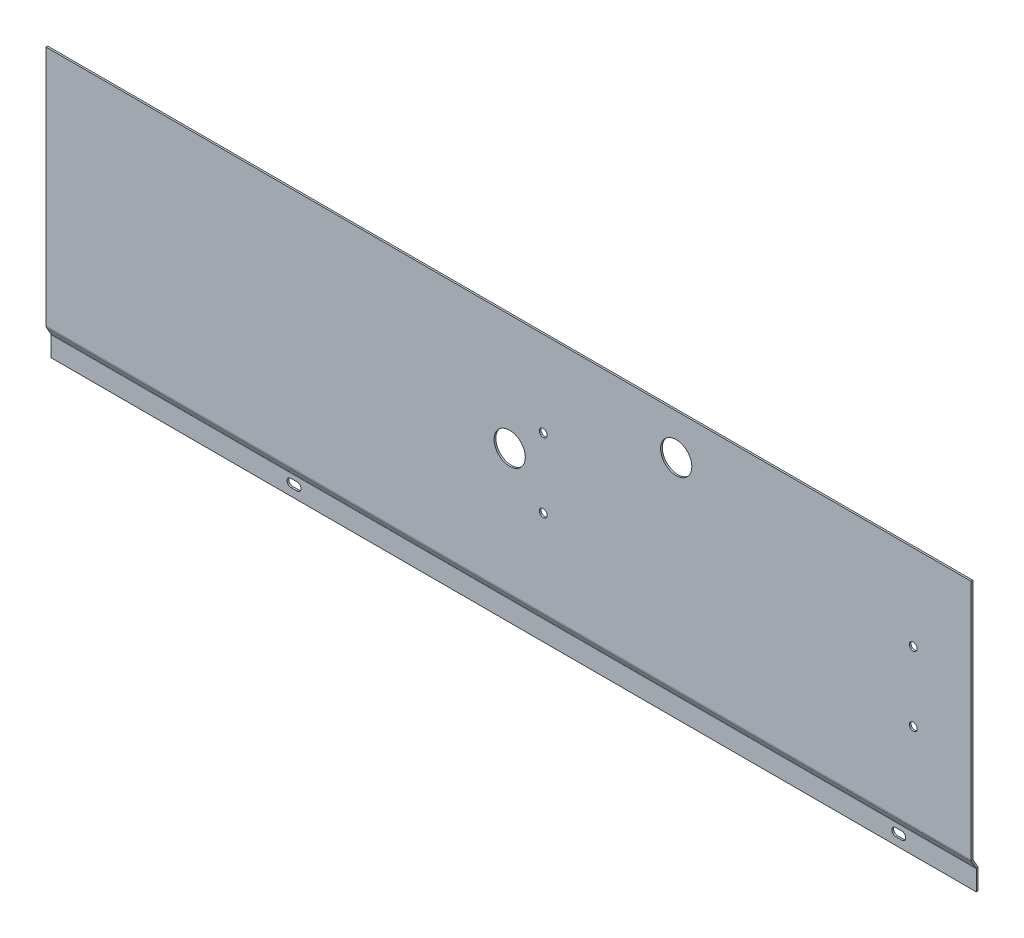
ISO-10303-21;
HEADER;
FILE_DESCRIPTION(('STEP AP214'),'2;1');
FILE_NAME('part.step','',(''),(''),'','','');
FILE_SCHEMA(('AUTOMOTIVE_DESIGN { 1 0 10303 214 1 1 1 1 }'));
ENDSEC;
DATA;
#1=APPLICATION_CONTEXT('core data for automotive mechanical design processes');
#2=APPLICATION_PROTOCOL_DEFINITION('international standard','automotive_design',2000,#1);
#3=PRODUCT_CONTEXT('',#1,'mechanical');
#4=PRODUCT('Part','Part','',(#3));
#5=PRODUCT_RELATED_PRODUCT_CATEGORY('part','',(#4));
#6=PRODUCT_DEFINITION_FORMATION('','',#4);
#7=PRODUCT_DEFINITION_CONTEXT('part definition',#1,'design');
#8=PRODUCT_DEFINITION('design','',#6,#7);
#9=PRODUCT_DEFINITION_SHAPE('','',#8);
#10=(LENGTH_UNIT() NAMED_UNIT(*) SI_UNIT(.MILLI.,.METRE.));
#11=(NAMED_UNIT(*) PLANE_ANGLE_UNIT() SI_UNIT($,.RADIAN.));
#12=(NAMED_UNIT(*) SI_UNIT($,.STERADIAN.) SOLID_ANGLE_UNIT());
#13=UNCERTAINTY_MEASURE_WITH_UNIT(LENGTH_MEASURE(1.E-05),#10,'distance_accuracy_value','');
#14=(GEOMETRIC_REPRESENTATION_CONTEXT(3) GLOBAL_UNCERTAINTY_ASSIGNED_CONTEXT((#13)) GLOBAL_UNIT_ASSIGNED_CONTEXT((#10,
#11,#12)) REPRESENTATION_CONTEXT('',''));
#15=CARTESIAN_POINT('',(0.,0.,0.));
#16=DIRECTION('',(0.,0.,1.));
#17=DIRECTION('',(1.,0.,0.));
#18=AXIS2_PLACEMENT_3D('',#15,#16,#17);
#19=CARTESIAN_POINT('',(800.,17.1961524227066,0.));
#20=DIRECTION('',(1.,0.,0.));
#21=DIRECTION('',(0.,0.,-1.));
#22=AXIS2_PLACEMENT_3D('',#19,#20,#21);
#23=PLANE('',#22);
#24=DIRECTION('',(0.,0.,1.));
#25=VECTOR('',#24,1.);
#26=CARTESIAN_POINT('',(800.,17.1961524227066,0.));
#27=LINE('',#26,#25);
#28=CARTESIAN_POINT('',(800.,17.1961524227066,0.));
#29=VERTEX_POINT('',#28);
#30=CARTESIAN_POINT('',(800.,17.1961524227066,1.5));
#31=VERTEX_POINT('',#30);
#32=EDGE_CURVE('E11',#29,#31,#27,.T.);
#33=ORIENTED_EDGE('',*,*,#32,.F.);
#34=CARTESIAN_POINT('',(800.,17.1961524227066,3.));
#35=DIRECTION('',(-1.,0.,0.));
#36=DIRECTION('',(0.,0.,1.));
#37=AXIS2_PLACEMENT_3D('',#34,#35,#36);
#38=CIRCLE('',#37,3.);
#39=CARTESIAN_POINT('',(800.,18.6961524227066,0.401923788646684));
#40=VERTEX_POINT('',#39);
#41=EDGE_CURVE('E350',#29,#40,#38,.F.);
#42=ORIENTED_EDGE('',*,*,#41,.T.);
#43=DIRECTION('',(0.,0.5,-0.866025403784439));
#44=VECTOR('',#43,1.);
#45=CARTESIAN_POINT('',(800.,17.9461524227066,1.70096189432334));
#46=LINE('',#45,#44);
#47=CARTESIAN_POINT('',(800.,17.9461524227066,1.70096189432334));
#48=VERTEX_POINT('',#47);
#49=EDGE_CURVE('E48',#48,#40,#46,.T.);
#50=ORIENTED_EDGE('',*,*,#49,.F.);
#51=CARTESIAN_POINT('',(800.,17.1961524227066,3.));
#52=DIRECTION('',(1.,0.,0.));
#53=DIRECTION('',(0.,0.,-1.));
#54=AXIS2_PLACEMENT_3D('',#51,#52,#53);
#55=CIRCLE('',#54,1.5);
#56=EDGE_CURVE('E334',#31,#48,#55,.T.);
#57=ORIENTED_EDGE('',*,*,#56,.F.);
#58=EDGE_LOOP('',(#33,#42,#50,#57));
#59=FACE_BOUND('',#58,.T.);
#60=ADVANCED_FACE('F40',(#59),#23,.T.);
#61=CARTESIAN_POINT('',(800.,17.9461524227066,1.70096189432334));
#62=DIRECTION('',(1.,0.,0.));
#63=DIRECTION('',(0.,0.,-1.));
#64=AXIS2_PLACEMENT_3D('',#61,#62,#63);
#65=PLANE('',#64);
#66=DIRECTION('',(0.,1.,0.));
#67=VECTOR('',#66,1.);
#68=CARTESIAN_POINT('',(800.,0.,0.));
#69=LINE('',#68,#67);
#70=CARTESIAN_POINT('',(800.,0.,0.));
#71=VERTEX_POINT('',#70);
#72=EDGE_CURVE('E346',#71,#29,#69,.T.);
#73=ORIENTED_EDGE('',*,*,#72,.T.);
#74=ORIENTED_EDGE('',*,*,#32,.T.);
#75=DIRECTION('',(0.,1.,0.));
#76=VECTOR('',#75,1.);
#77=CARTESIAN_POINT('',(800.,0.,1.5));
#78=LINE('',#77,#76);
#79=CARTESIAN_POINT('',(800.,0.,1.5));
#80=VERTEX_POINT('',#79);
#81=EDGE_CURVE('E338',#80,#31,#78,.T.);
#82=ORIENTED_EDGE('',*,*,#81,.F.);
#83=DIRECTION('',(0.,0.,1.));
#84=VECTOR('',#83,1.);
#85=CARTESIAN_POINT('',(800.,0.,0.));
#86=LINE('',#85,#84);
#87=EDGE_CURVE('E342',#71,#80,#86,.T.);
#88=ORIENTED_EDGE('',*,*,#87,.F.);
#89=EDGE_LOOP('',(#73,#74,#82,#88));
#90=FACE_BOUND('',#89,.T.);
#91=ADVANCED_FACE('F466',(#90),#65,.T.);
#92=CARTESIAN_POINT('',(0.,18.6961524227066,0.401923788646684));
#93=DIRECTION('',(-1.,0.,0.));
#94=DIRECTION('',(0.,0.,1.));
#95=AXIS2_PLACEMENT_3D('',#92,#93,#94);
#96=PLANE('',#95);
#97=DIRECTION('',(0.,-0.5,0.866025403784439));
#98=VECTOR('',#97,1.);
#99=CARTESIAN_POINT('',(0.,18.6961524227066,0.401923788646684));
#100=LINE('',#99,#98);
#101=CARTESIAN_POINT('',(0.,18.6961524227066,0.401923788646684));
#102=VERTEX_POINT('',#101);
#103=CARTESIAN_POINT('',(0.,17.9461524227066,1.70096189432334));
#104=VERTEX_POINT('',#103);
#105=EDGE_CURVE('E421',#102,#104,#100,.T.);
#106=ORIENTED_EDGE('',*,*,#105,.F.);
#107=CARTESIAN_POINT('',(0.,17.1961524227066,3.));
#108=DIRECTION('',(-1.,0.,0.));
#109=DIRECTION('',(0.,0.,1.));
#110=AXIS2_PLACEMENT_3D('',#107,#108,#109);
#111=CIRCLE('',#110,3.);
#112=CARTESIAN_POINT('',(0.,17.1961524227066,0.));
#113=VERTEX_POINT('',#112);
#114=EDGE_CURVE('E303',#113,#102,#111,.F.);
#115=ORIENTED_EDGE('',*,*,#114,.F.);
#116=DIRECTION('',(0.,0.,-1.));
#117=VECTOR('',#116,1.);
#118=CARTESIAN_POINT('',(0.,17.1961524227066,1.5));
#119=LINE('',#118,#117);
#120=CARTESIAN_POINT('',(0.,17.1961524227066,1.5));
#121=VERTEX_POINT('',#120);
#122=EDGE_CURVE('E418',#121,#113,#119,.T.);
#123=ORIENTED_EDGE('',*,*,#122,.F.);
#124=CARTESIAN_POINT('',(0.,17.1961524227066,3.));
#125=DIRECTION('',(1.,0.,0.));
#126=DIRECTION('',(0.,0.,-1.));
#127=AXIS2_PLACEMENT_3D('',#124,#125,#126);
#128=CIRCLE('',#127,1.5);
#129=EDGE_CURVE('E287',#121,#104,#128,.T.);
#130=ORIENTED_EDGE('',*,*,#129,.T.);
#131=EDGE_LOOP('',(#106,#115,#123,#130));
#132=FACE_BOUND('',#131,.T.);
#133=ADVANCED_FACE('F476',(#132),#96,.T.);
#134=CARTESIAN_POINT('',(0.,17.1961524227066,1.5));
#135=DIRECTION('',(-1.,0.,0.));
#136=DIRECTION('',(0.,0.,1.));
#137=AXIS2_PLACEMENT_3D('',#134,#135,#136);
#138=PLANE('',#137);
#139=DIRECTION('',(0.,0.866025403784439,0.5));
#140=VECTOR('',#139,1.);
#141=CARTESIAN_POINT('',(0.,18.,0.));
#142=LINE('',#141,#140);
#143=CARTESIAN_POINT('',(0.,25.4461524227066,4.29903810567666));
#144=VERTEX_POINT('',#143);
#145=EDGE_CURVE('E307',#102,#144,#142,.T.);
#146=ORIENTED_EDGE('',*,*,#145,.F.);
#147=ORIENTED_EDGE('',*,*,#105,.T.);
#148=DIRECTION('',(0.,0.866025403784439,0.5));
#149=VECTOR('',#148,1.);
#150=CARTESIAN_POINT('',(0.,17.25,1.29903810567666));
#151=LINE('',#150,#149);
#152=CARTESIAN_POINT('',(0.,24.6961524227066,5.59807621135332));
#153=VERTEX_POINT('',#152);
#154=EDGE_CURVE('E283',#104,#153,#151,.T.);
#155=ORIENTED_EDGE('',*,*,#154,.T.);
#156=DIRECTION('',(0.,0.5,-0.866025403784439));
#157=VECTOR('',#156,1.);
#158=CARTESIAN_POINT('',(0.,24.6961524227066,5.59807621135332));
#159=LINE('',#158,#157);
#160=EDGE_CURVE('E406',#153,#144,#159,.T.);
#161=ORIENTED_EDGE('',*,*,#160,.T.);
#162=EDGE_LOOP('',(#146,#147,#155,#161));
#163=FACE_BOUND('',#162,.T.);
#164=ADVANCED_FACE('F478',(#163),#138,.T.);
#165=CARTESIAN_POINT('',(800.,25.4461524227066,4.29903810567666));
#166=DIRECTION('',(1.,0.,0.));
#167=DIRECTION('',(0.,0.,-1.));
#168=AXIS2_PLACEMENT_3D('',#165,#166,#167);
#169=PLANE('',#168);
#170=DIRECTION('',(0.,-0.5,0.866025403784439));
#171=VECTOR('',#170,1.);
#172=CARTESIAN_POINT('',(800.,25.4461524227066,4.29903810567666));
#173=LINE('',#172,#171);
#174=CARTESIAN_POINT('',(800.,25.4461524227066,4.29903810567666));
#175=VERTEX_POINT('',#174);
#176=CARTESIAN_POINT('',(800.,24.6961524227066,5.59807621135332));
#177=VERTEX_POINT('',#176);
#178=EDGE_CURVE('E415',#175,#177,#173,.T.);
#179=ORIENTED_EDGE('',*,*,#178,.F.);
#180=CARTESIAN_POINT('',(800.,26.1961524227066,3.));
#181=DIRECTION('',(1.,0.,0.));
#182=DIRECTION('',(0.,0.,-1.));
#183=AXIS2_PLACEMENT_3D('',#180,#181,#182);
#184=CIRCLE('',#183,1.5);
#185=CARTESIAN_POINT('',(800.,26.1961524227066,4.5));
#186=VERTEX_POINT('',#185);
#187=EDGE_CURVE('E358',#175,#186,#184,.F.);
#188=ORIENTED_EDGE('',*,*,#187,.T.);
#189=DIRECTION('',(0.,0.,-1.));
#190=VECTOR('',#189,1.);
#191=CARTESIAN_POINT('',(800.,26.1961524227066,6.));
#192=LINE('',#191,#190);
#193=CARTESIAN_POINT('',(800.,26.1961524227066,6.));
#194=VERTEX_POINT('',#193);
#195=EDGE_CURVE('E412',#194,#186,#192,.T.);
#196=ORIENTED_EDGE('',*,*,#195,.F.);
#197=CARTESIAN_POINT('',(800.,26.1961524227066,3.));
#198=DIRECTION('',(1.,0.,0.));
#199=DIRECTION('',(0.,0.,-1.));
#200=AXIS2_PLACEMENT_3D('',#197,#198,#199);
#201=CIRCLE('',#200,3.);
#202=EDGE_CURVE('E326',#177,#194,#201,.F.);
#203=ORIENTED_EDGE('',*,*,#202,.F.);
#204=EDGE_LOOP('',(#179,#188,#196,#203));
#205=FACE_BOUND('',#204,.T.);
#206=ADVANCED_FACE('F447',(#205),#169,.T.);
#207=CARTESIAN_POINT('',(800.,26.1961524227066,6.));
#208=DIRECTION('',(1.,0.,0.));
#209=DIRECTION('',(0.,0.,-1.));
#210=AXIS2_PLACEMENT_3D('',#207,#208,#209);
#211=PLANE('',#210);
#212=DIRECTION('',(0.,0.866025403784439,0.5));
#213=VECTOR('',#212,1.);
#214=CARTESIAN_POINT('',(800.,18.,0.));
#215=LINE('',#214,#213);
#216=EDGE_CURVE('E354',#40,#175,#215,.T.);
#217=ORIENTED_EDGE('',*,*,#216,.T.);
#218=ORIENTED_EDGE('',*,*,#178,.T.);
#219=DIRECTION('',(0.,0.866025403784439,0.5));
#220=VECTOR('',#219,1.);
#221=CARTESIAN_POINT('',(800.,17.25,1.29903810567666));
#222=LINE('',#221,#220);
#223=EDGE_CURVE('E330',#48,#177,#222,.T.);
#224=ORIENTED_EDGE('',*,*,#223,.F.);
#225=ORIENTED_EDGE('',*,*,#49,.T.);
#226=EDGE_LOOP('',(#217,#218,#224,#225));
#227=FACE_BOUND('',#226,.T.);
#228=ADVANCED_FACE('F426',(#227),#211,.T.);
#229=CARTESIAN_POINT('',(0.,26.1961524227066,4.5));
#230=DIRECTION('',(-1.,0.,0.));
#231=DIRECTION('',(0.,0.,1.));
#232=AXIS2_PLACEMENT_3D('',#229,#230,#231);
#233=PLANE('',#232);
#234=DIRECTION('',(0.,0.,1.));
#235=VECTOR('',#234,1.);
#236=CARTESIAN_POINT('',(0.,26.1961524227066,4.5));
#237=LINE('',#236,#235);
#238=CARTESIAN_POINT('',(0.,26.1961524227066,4.5));
#239=VERTEX_POINT('',#238);
#240=CARTESIAN_POINT('',(0.,26.1961524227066,6.));
#241=VERTEX_POINT('',#240);
#242=EDGE_CURVE('E409',#239,#241,#237,.T.);
#243=ORIENTED_EDGE('',*,*,#242,.F.);
#244=CARTESIAN_POINT('',(0.,26.1961524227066,3.));
#245=DIRECTION('',(1.,0.,0.));
#246=DIRECTION('',(0.,0.,-1.));
#247=AXIS2_PLACEMENT_3D('',#244,#245,#246);
#248=CIRCLE('',#247,1.5);
#249=EDGE_CURVE('E311',#144,#239,#248,.F.);
#250=ORIENTED_EDGE('',*,*,#249,.F.);
#251=ORIENTED_EDGE('',*,*,#160,.F.);
#252=CARTESIAN_POINT('',(0.,26.1961524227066,3.));
#253=DIRECTION('',(1.,0.,0.));
#254=DIRECTION('',(0.,0.,-1.));
#255=AXIS2_PLACEMENT_3D('',#252,#253,#254);
#256=CIRCLE('',#255,3.);
#257=EDGE_CURVE('E279',#153,#241,#256,.F.);
#258=ORIENTED_EDGE('',*,*,#257,.T.);
#259=EDGE_LOOP('',(#243,#250,#251,#258));
#260=FACE_BOUND('',#259,.T.);
#261=ADVANCED_FACE('F480',(#260),#233,.T.);
#262=CARTESIAN_POINT('',(0.,24.6961524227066,5.59807621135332));
#263=DIRECTION('',(-1.,0.,0.));
#264=DIRECTION('',(0.,0.,1.));
#265=AXIS2_PLACEMENT_3D('',#262,#263,#264);
#266=PLANE('',#265);
#267=DIRECTION('',(0.,1.,0.));
#268=VECTOR('',#267,1.);
#269=CARTESIAN_POINT('',(0.,25.7942286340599,4.5));
#270=LINE('',#269,#268);
#271=CARTESIAN_POINT('',(0.,235.,4.5));
#272=VERTEX_POINT('',#271);
#273=EDGE_CURVE('E258',#239,#272,#270,.T.);
#274=ORIENTED_EDGE('',*,*,#273,.F.);
#275=ORIENTED_EDGE('',*,*,#242,.T.);
#276=DIRECTION('',(0.,1.,0.));
#277=VECTOR('',#276,1.);
#278=CARTESIAN_POINT('',(0.,25.7942286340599,6.));
#279=LINE('',#278,#277);
#280=CARTESIAN_POINT('',(0.,235.,6.));
#281=VERTEX_POINT('',#280);
#282=EDGE_CURVE('E275',#241,#281,#279,.T.);
#283=ORIENTED_EDGE('',*,*,#282,.T.);
#284=DIRECTION('',(0.,0.,-1.));
#285=VECTOR('',#284,1.);
#286=CARTESIAN_POINT('',(0.,235.,6.));
#287=LINE('',#286,#285);
#288=EDGE_CURVE('E271',#281,#272,#287,.T.);
#289=ORIENTED_EDGE('',*,*,#288,.T.);
#290=EDGE_LOOP('',(#274,#275,#283,#289));
#291=FACE_BOUND('',#290,.T.);
#292=ADVANCED_FACE('F486',(#291),#266,.T.);
#293=CARTESIAN_POINT('',(800.,25.7942286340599,4.5));
#294=DIRECTION('',(0.,0.,1.));
#295=DIRECTION('',(1.,0.,0.));
#296=AXIS2_PLACEMENT_3D('',#293,#294,#295);
#297=PLANE('',#296);
#298=CARTESIAN_POINT('',(750.,101.,4.5));
#299=DIRECTION('',(0.,0.,1.));
#300=DIRECTION('',(1.,0.,0.));
#301=AXIS2_PLACEMENT_3D('',#298,#299,#300);
#302=CIRCLE('',#301,3.39999999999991);
#303=CARTESIAN_POINT('',(753.4,101.,4.5));
#304=VERTEX_POINT('',#303);
#305=EDGE_CURVE('E534',#304,#304,#302,.T.);
#306=ORIENTED_EDGE('',*,*,#305,.T.);
#307=EDGE_LOOP('',(#306));
#308=FACE_BOUND('',#307,.T.);
#309=CARTESIAN_POINT('',(750.,161.,4.5));
#310=DIRECTION('',(0.,0.,1.));
#311=DIRECTION('',(1.,0.,0.));
#312=AXIS2_PLACEMENT_3D('',#309,#310,#311);
#313=CIRCLE('',#312,3.39999999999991);
#314=CARTESIAN_POINT('',(753.4,161.,4.5));
#315=VERTEX_POINT('',#314);
#316=EDGE_CURVE('E538',#315,#315,#313,.T.);
#317=ORIENTED_EDGE('',*,*,#316,.T.);
#318=EDGE_LOOP('',(#317));
#319=FACE_BOUND('',#318,.T.);
#320=CARTESIAN_POINT('',(430.,101.,4.5));
#321=DIRECTION('',(0.,0.,1.));
#322=DIRECTION('',(1.,0.,0.));
#323=AXIS2_PLACEMENT_3D('',#320,#321,#322);
#324=CIRCLE('',#323,3.40000000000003);
#325=CARTESIAN_POINT('',(433.4,101.,4.5));
#326=VERTEX_POINT('',#325);
#327=EDGE_CURVE('E542',#326,#326,#324,.T.);
#328=ORIENTED_EDGE('',*,*,#327,.T.);
#329=EDGE_LOOP('',(#328));
#330=FACE_BOUND('',#329,.T.);
#331=CARTESIAN_POINT('',(430.,161.,4.5));
#332=DIRECTION('',(0.,0.,1.));
#333=DIRECTION('',(1.,0.,0.));
#334=AXIS2_PLACEMENT_3D('',#331,#332,#333);
#335=CIRCLE('',#334,3.40000000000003);
#336=CARTESIAN_POINT('',(433.4,161.,4.5));
#337=VERTEX_POINT('',#336);
#338=EDGE_CURVE('E546',#337,#337,#335,.T.);
#339=ORIENTED_EDGE('',*,*,#338,.T.);
#340=EDGE_LOOP('',(#339));
#341=FACE_BOUND('',#340,.T.);
#342=CARTESIAN_POINT('',(401.,135.,4.5));
#343=DIRECTION('',(0.,0.,1.));
#344=DIRECTION('',(1.,0.,0.));
#345=AXIS2_PLACEMENT_3D('',#342,#343,#344);
#346=CIRCLE('',#345,13.5);
#347=CARTESIAN_POINT('',(414.5,135.,4.5));
#348=VERTEX_POINT('',#347);
#349=EDGE_CURVE('E550',#348,#348,#346,.T.);
#350=ORIENTED_EDGE('',*,*,#349,.T.);
#351=EDGE_LOOP('',(#350));
#352=FACE_BOUND('',#351,.T.);
#353=CARTESIAN_POINT('',(545.,200.,4.5));
#354=DIRECTION('',(0.,0.,1.));
#355=DIRECTION('',(1.,0.,0.));
#356=AXIS2_PLACEMENT_3D('',#353,#354,#355);
#357=CIRCLE('',#356,13.4999999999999);
#358=CARTESIAN_POINT('',(558.5,200.,4.5));
#359=VERTEX_POINT('',#358);
#360=EDGE_CURVE('E187',#359,#359,#357,.T.);
#361=ORIENTED_EDGE('',*,*,#360,.T.);
#362=EDGE_LOOP('',(#361));
#363=FACE_BOUND('',#362,.T.);
#364=ORIENTED_EDGE('',*,*,#273,.T.);
#365=DIRECTION('',(-1.,0.,0.));
#366=VECTOR('',#365,1.);
#367=CARTESIAN_POINT('',(800.,235.,4.5));
#368=LINE('',#367,#366);
#369=CARTESIAN_POINT('',(800.,235.,4.5));
#370=VERTEX_POINT('',#369);
#371=EDGE_CURVE('E403',#370,#272,#368,.T.);
#372=ORIENTED_EDGE('',*,*,#371,.F.);
#373=DIRECTION('',(0.,1.,0.));
#374=VECTOR('',#373,1.);
#375=CARTESIAN_POINT('',(800.,25.7942286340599,4.5));
#376=LINE('',#375,#374);
#377=EDGE_CURVE('E315',#186,#370,#376,.T.);
#378=ORIENTED_EDGE('',*,*,#377,.F.);
#379=DIRECTION('',(-1.,0.,0.));
#380=VECTOR('',#379,1.);
#381=CARTESIAN_POINT('',(800.,26.1961524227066,4.5));
#382=LINE('',#381,#380);
#383=EDGE_CURVE('E362',#186,#239,#382,.T.);
#384=ORIENTED_EDGE('',*,*,#383,.T.);
#385=EDGE_LOOP('',(#364,#372,#378,#384));
#386=FACE_BOUND('',#385,.T.);
#387=ADVANCED_FACE('F483',(#308,#319,#330,#341,#352,#363,#386),#297,.F.);
#388=CARTESIAN_POINT('',(800.,235.,6.));
#389=DIRECTION('',(0.,1.,0.));
#390=DIRECTION('',(0.,0.,1.));
#391=AXIS2_PLACEMENT_3D('',#388,#389,#390);
#392=PLANE('',#391);
#393=ORIENTED_EDGE('',*,*,#288,.F.);
#394=DIRECTION('',(-1.,0.,0.));
#395=VECTOR('',#394,1.);
#396=CARTESIAN_POINT('',(800.,235.,6.));
#397=LINE('',#396,#395);
#398=CARTESIAN_POINT('',(800.,235.,6.));
#399=VERTEX_POINT('',#398);
#400=EDGE_CURVE('E400',#399,#281,#397,.T.);
#401=ORIENTED_EDGE('',*,*,#400,.F.);
#402=DIRECTION('',(0.,0.,-1.));
#403=VECTOR('',#402,1.);
#404=CARTESIAN_POINT('',(800.,235.,6.));
#405=LINE('',#404,#403);
#406=EDGE_CURVE('E318',#399,#370,#405,.T.);
#407=ORIENTED_EDGE('',*,*,#406,.T.);
#408=ORIENTED_EDGE('',*,*,#371,.T.);
#409=EDGE_LOOP('',(#393,#401,#407,#408));
#410=FACE_BOUND('',#409,.T.);
#411=ADVANCED_FACE('F490',(#410),#392,.T.);
#412=CARTESIAN_POINT('',(800.,25.7942286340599,6.));
#413=DIRECTION('',(0.,0.,1.));
#414=DIRECTION('',(1.,0.,0.));
#415=AXIS2_PLACEMENT_3D('',#412,#413,#414);
#416=PLANE('',#415);
#417=CARTESIAN_POINT('',(750.,101.,6.));
#418=DIRECTION('',(0.,0.,1.));
#419=DIRECTION('',(1.,0.,0.));
#420=AXIS2_PLACEMENT_3D('',#417,#418,#419);
#421=CIRCLE('',#420,3.39999999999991);
#422=CARTESIAN_POINT('',(753.4,101.,6.));
#423=VERTEX_POINT('',#422);
#424=EDGE_CURVE('E959',#423,#423,#421,.T.);
#425=ORIENTED_EDGE('',*,*,#424,.F.);
#426=EDGE_LOOP('',(#425));
#427=FACE_BOUND('',#426,.T.);
#428=CARTESIAN_POINT('',(750.,161.,6.));
#429=DIRECTION('',(0.,0.,1.));
#430=DIRECTION('',(1.,0.,0.));
#431=AXIS2_PLACEMENT_3D('',#428,#429,#430);
#432=CIRCLE('',#431,3.39999999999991);
#433=CARTESIAN_POINT('',(753.4,161.,6.));
#434=VERTEX_POINT('',#433);
#435=EDGE_CURVE('E961',#434,#434,#432,.T.);
#436=ORIENTED_EDGE('',*,*,#435,.F.);
#437=EDGE_LOOP('',(#436));
#438=FACE_BOUND('',#437,.T.);
#439=CARTESIAN_POINT('',(430.,101.,6.));
#440=DIRECTION('',(0.,0.,1.));
#441=DIRECTION('',(1.,0.,0.));
#442=AXIS2_PLACEMENT_3D('',#439,#440,#441);
#443=CIRCLE('',#442,3.40000000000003);
#444=CARTESIAN_POINT('',(433.4,101.,6.));
#445=VERTEX_POINT('',#444);
#446=EDGE_CURVE('E971',#445,#445,#443,.T.);
#447=ORIENTED_EDGE('',*,*,#446,.F.);
#448=EDGE_LOOP('',(#447));
#449=FACE_BOUND('',#448,.T.);
#450=CARTESIAN_POINT('',(430.,161.,6.));
#451=DIRECTION('',(0.,0.,1.));
#452=DIRECTION('',(1.,0.,0.));
#453=AXIS2_PLACEMENT_3D('',#450,#451,#452);
#454=CIRCLE('',#453,3.40000000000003);
#455=CARTESIAN_POINT('',(433.4,161.,6.));
#456=VERTEX_POINT('',#455);
#457=EDGE_CURVE('E977',#456,#456,#454,.T.);
#458=ORIENTED_EDGE('',*,*,#457,.F.);
#459=EDGE_LOOP('',(#458));
#460=FACE_BOUND('',#459,.T.);
#461=CARTESIAN_POINT('',(401.,135.,6.));
#462=DIRECTION('',(0.,0.,1.));
#463=DIRECTION('',(1.,0.,0.));
#464=AXIS2_PLACEMENT_3D('',#461,#462,#463);
#465=CIRCLE('',#464,13.5);
#466=CARTESIAN_POINT('',(414.5,135.,6.));
#467=VERTEX_POINT('',#466);
#468=EDGE_CURVE('E983',#467,#467,#465,.T.);
#469=ORIENTED_EDGE('',*,*,#468,.F.);
#470=EDGE_LOOP('',(#469));
#471=FACE_BOUND('',#470,.T.);
#472=CARTESIAN_POINT('',(545.,200.,6.));
#473=DIRECTION('',(0.,0.,1.));
#474=DIRECTION('',(1.,0.,0.));
#475=AXIS2_PLACEMENT_3D('',#472,#473,#474);
#476=CIRCLE('',#475,13.4999999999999);
#477=CARTESIAN_POINT('',(558.5,200.,6.));
#478=VERTEX_POINT('',#477);
#479=EDGE_CURVE('E555',#478,#478,#476,.T.);
#480=ORIENTED_EDGE('',*,*,#479,.F.);
#481=EDGE_LOOP('',(#480));
#482=FACE_BOUND('',#481,.T.);
#483=ORIENTED_EDGE('',*,*,#282,.F.);
#484=DIRECTION('',(-1.,0.,0.));
#485=VECTOR('',#484,1.);
#486=CARTESIAN_POINT('',(800.,26.1961524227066,6.));
#487=LINE('',#486,#485);
#488=EDGE_CURVE('E396',#194,#241,#487,.T.);
#489=ORIENTED_EDGE('',*,*,#488,.F.);
#490=DIRECTION('',(0.,1.,0.));
#491=VECTOR('',#490,1.);
#492=CARTESIAN_POINT('',(800.,25.7942286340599,6.));
#493=LINE('',#492,#491);
#494=EDGE_CURVE('E322',#194,#399,#493,.T.);
#495=ORIENTED_EDGE('',*,*,#494,.T.);
#496=ORIENTED_EDGE('',*,*,#400,.T.);
#497=EDGE_LOOP('',(#483,#489,#495,#496));
#498=FACE_BOUND('',#497,.T.);
#499=ADVANCED_FACE('F496',(#427,#438,#449,#460,#471,#482,#498),#416,.T.);
#500=CARTESIAN_POINT('',(800.,26.1961524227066,3.));
#501=DIRECTION('',(-1.,0.,0.));
#502=DIRECTION('',(0.,0.,1.));
#503=AXIS2_PLACEMENT_3D('',#500,#501,#502);
#504=CYLINDRICAL_SURFACE('',#503,3.);
#505=ORIENTED_EDGE('',*,*,#257,.F.);
#506=DIRECTION('',(-1.,0.,0.));
#507=VECTOR('',#506,1.);
#508=CARTESIAN_POINT('',(800.,24.6961524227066,5.59807621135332));
#509=LINE('',#508,#507);
#510=EDGE_CURVE('E392',#177,#153,#509,.T.);
#511=ORIENTED_EDGE('',*,*,#510,.F.);
#512=ORIENTED_EDGE('',*,*,#202,.T.);
#513=ORIENTED_EDGE('',*,*,#488,.T.);
#514=EDGE_LOOP('',(#505,#511,#512,#513));
#515=FACE_BOUND('',#514,.T.);
#516=ADVANCED_FACE('F453',(#515),#504,.T.);
#517=CARTESIAN_POINT('',(800.,17.25,1.29903810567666));
#518=DIRECTION('',(0.,-0.5,0.866025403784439));
#519=DIRECTION('',(0.,-0.866025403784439,-0.5));
#520=AXIS2_PLACEMENT_3D('',#517,#518,#519);
#521=PLANE('',#520);
#522=ORIENTED_EDGE('',*,*,#154,.F.);
#523=DIRECTION('',(-1.,0.,0.));
#524=VECTOR('',#523,1.);
#525=CARTESIAN_POINT('',(800.,17.9461524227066,1.70096189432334));
#526=LINE('',#525,#524);
#527=EDGE_CURVE('E388',#48,#104,#526,.T.);
#528=ORIENTED_EDGE('',*,*,#527,.F.);
#529=ORIENTED_EDGE('',*,*,#223,.T.);
#530=ORIENTED_EDGE('',*,*,#510,.T.);
#531=EDGE_LOOP('',(#522,#528,#529,#530));
#532=FACE_BOUND('',#531,.T.);
#533=ADVANCED_FACE('F456',(#532),#521,.T.);
#534=CARTESIAN_POINT('',(800.,17.1961524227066,3.));
#535=DIRECTION('',(-1.,0.,0.));
#536=DIRECTION('',(0.,0.,1.));
#537=AXIS2_PLACEMENT_3D('',#534,#535,#536);
#538=CYLINDRICAL_SURFACE('',#537,1.5);
#539=ORIENTED_EDGE('',*,*,#129,.F.);
#540=DIRECTION('',(-1.,0.,0.));
#541=VECTOR('',#540,1.);
#542=CARTESIAN_POINT('',(800.,17.1961524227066,1.5));
#543=LINE('',#542,#541);
#544=EDGE_CURVE('E384',#31,#121,#543,.T.);
#545=ORIENTED_EDGE('',*,*,#544,.F.);
#546=ORIENTED_EDGE('',*,*,#56,.T.);
#547=ORIENTED_EDGE('',*,*,#527,.T.);
#548=EDGE_LOOP('',(#539,#545,#546,#547));
#549=FACE_BOUND('',#548,.T.);
#550=ADVANCED_FACE('F459',(#549),#538,.F.);
#551=CARTESIAN_POINT('',(800.,0.,1.5));
#552=DIRECTION('',(0.,0.,1.));
#553=DIRECTION('',(1.,0.,0.));
#554=AXIS2_PLACEMENT_3D('',#551,#552,#553);
#555=PLANE('',#554);
#556=CARTESIAN_POINT('',(207.4,10.,1.5));
#557=DIRECTION('',(0.,0.,1.));
#558=DIRECTION('',(-1.,0.,0.));
#559=AXIS2_PLACEMENT_3D('',#556,#557,#558);
#560=CIRCLE('',#559,3.4);
#561=CARTESIAN_POINT('',(207.4,13.4,1.5));
#562=VERTEX_POINT('',#561);
#563=CARTESIAN_POINT('',(207.4,6.6,1.5));
#564=VERTEX_POINT('',#563);
#565=EDGE_CURVE('E55',#562,#564,#560,.T.);
#566=ORIENTED_EDGE('',*,*,#565,.F.);
#567=DIRECTION('',(-1.,0.,0.));
#568=VECTOR('',#567,1.);
#569=CARTESIAN_POINT('',(207.4,13.4,1.5));
#570=LINE('',#569,#568);
#571=CARTESIAN_POINT('',(212.6,13.4,1.5));
#572=VERTEX_POINT('',#571);
#573=EDGE_CURVE('E197',#572,#562,#570,.T.);
#574=ORIENTED_EDGE('',*,*,#573,.F.);
#575=CARTESIAN_POINT('',(212.6,10.,1.5));
#576=DIRECTION('',(0.,0.,1.));
#577=DIRECTION('',(1.,0.,0.));
#578=AXIS2_PLACEMENT_3D('',#575,#576,#577);
#579=CIRCLE('',#578,3.4);
#580=CARTESIAN_POINT('',(212.6,6.6,1.5));
#581=VERTEX_POINT('',#580);
#582=EDGE_CURVE('E190',#581,#572,#579,.T.);
#583=ORIENTED_EDGE('',*,*,#582,.F.);
#584=DIRECTION('',(1.,0.,0.));
#585=VECTOR('',#584,1.);
#586=CARTESIAN_POINT('',(207.4,6.6,1.5));
#587=LINE('',#586,#585);
#588=EDGE_CURVE('E178',#564,#581,#587,.T.);
#589=ORIENTED_EDGE('',*,*,#588,.F.);
#590=EDGE_LOOP('',(#566,#574,#583,#589));
#591=FACE_BOUND('',#590,.T.);
#592=CARTESIAN_POINT('',(730.4,10.,1.5));
#593=DIRECTION('',(0.,0.,1.));
#594=DIRECTION('',(-1.,0.,0.));
#595=AXIS2_PLACEMENT_3D('',#592,#593,#594);
#596=CIRCLE('',#595,3.4);
#597=CARTESIAN_POINT('',(730.4,13.4,1.5));
#598=VERTEX_POINT('',#597);
#599=CARTESIAN_POINT('',(730.4,6.6,1.5));
#600=VERTEX_POINT('',#599);
#601=EDGE_CURVE('E224',#598,#600,#596,.T.);
#602=ORIENTED_EDGE('',*,*,#601,.F.);
#603=DIRECTION('',(-1.,0.,0.));
#604=VECTOR('',#603,1.);
#605=CARTESIAN_POINT('',(730.4,13.4,1.5));
#606=LINE('',#605,#604);
#607=CARTESIAN_POINT('',(735.6,13.4,1.5));
#608=VERTEX_POINT('',#607);
#609=EDGE_CURVE('E234',#608,#598,#606,.T.);
#610=ORIENTED_EDGE('',*,*,#609,.F.);
#611=CARTESIAN_POINT('',(735.6,10.,1.5));
#612=DIRECTION('',(0.,0.,1.));
#613=DIRECTION('',(1.,0.,0.));
#614=AXIS2_PLACEMENT_3D('',#611,#612,#613);
#615=CIRCLE('',#614,3.4);
#616=CARTESIAN_POINT('',(735.6,6.6,1.5));
#617=VERTEX_POINT('',#616);
#618=EDGE_CURVE('E230',#617,#608,#615,.T.);
#619=ORIENTED_EDGE('',*,*,#618,.F.);
#620=DIRECTION('',(1.,0.,0.));
#621=VECTOR('',#620,1.);
#622=CARTESIAN_POINT('',(730.4,6.6,1.5));
#623=LINE('',#622,#621);
#624=EDGE_CURVE('E226',#600,#617,#623,.T.);
#625=ORIENTED_EDGE('',*,*,#624,.F.);
#626=EDGE_LOOP('',(#602,#610,#619,#625));
#627=FACE_BOUND('',#626,.T.);
#628=DIRECTION('',(0.,1.,0.));
#629=VECTOR('',#628,1.);
#630=CARTESIAN_POINT('',(0.,0.,1.5));
#631=LINE('',#630,#629);
#632=CARTESIAN_POINT('',(0.,0.,1.5));
#633=VERTEX_POINT('',#632);
#634=EDGE_CURVE('E291',#633,#121,#631,.T.);
#635=ORIENTED_EDGE('',*,*,#634,.F.);
#636=DIRECTION('',(-1.,0.,0.));
#637=VECTOR('',#636,1.);
#638=CARTESIAN_POINT('',(800.,0.,1.5));
#639=LINE('',#638,#637);
#640=EDGE_CURVE('E381',#80,#633,#639,.T.);
#641=ORIENTED_EDGE('',*,*,#640,.F.);
#642=ORIENTED_EDGE('',*,*,#81,.T.);
#643=ORIENTED_EDGE('',*,*,#544,.T.);
#644=EDGE_LOOP('',(#635,#641,#642,#643));
#645=FACE_BOUND('',#644,.T.);
#646=ADVANCED_FACE('F195',(#591,#627,#645),#555,.T.);
#647=CARTESIAN_POINT('',(800.,0.,0.));
#648=DIRECTION('',(0.,-1.,0.));
#649=DIRECTION('',(0.,0.,-1.));
#650=AXIS2_PLACEMENT_3D('',#647,#648,#649);
#651=PLANE('',#650);
#652=DIRECTION('',(0.,0.,1.));
#653=VECTOR('',#652,1.);
#654=CARTESIAN_POINT('',(0.,0.,0.));
#655=LINE('',#654,#653);
#656=CARTESIAN_POINT('',(0.,0.,0.));
#657=VERTEX_POINT('',#656);
#658=EDGE_CURVE('E295',#657,#633,#655,.T.);
#659=ORIENTED_EDGE('',*,*,#658,.F.);
#660=DIRECTION('',(-1.,0.,0.));
#661=VECTOR('',#660,1.);
#662=CARTESIAN_POINT('',(800.,0.,0.));
#663=LINE('',#662,#661);
#664=EDGE_CURVE('E378',#71,#657,#663,.T.);
#665=ORIENTED_EDGE('',*,*,#664,.F.);
#666=ORIENTED_EDGE('',*,*,#87,.T.);
#667=ORIENTED_EDGE('',*,*,#640,.T.);
#668=EDGE_LOOP('',(#659,#665,#666,#667));
#669=FACE_BOUND('',#668,.T.);
#670=ADVANCED_FACE('F469',(#669),#651,.T.);
#671=CARTESIAN_POINT('',(800.,0.,0.));
#672=DIRECTION('',(0.,0.,1.));
#673=DIRECTION('',(1.,0.,0.));
#674=AXIS2_PLACEMENT_3D('',#671,#672,#673);
#675=PLANE('',#674);
#676=DIRECTION('',(-1.,0.,0.));
#677=VECTOR('',#676,1.);
#678=CARTESIAN_POINT('',(207.4,13.4,0.));
#679=LINE('',#678,#677);
#680=CARTESIAN_POINT('',(212.6,13.4,0.));
#681=VERTEX_POINT('',#680);
#682=CARTESIAN_POINT('',(207.4,13.4,0.));
#683=VERTEX_POINT('',#682);
#684=EDGE_CURVE('E215',#681,#683,#679,.T.);
#685=ORIENTED_EDGE('',*,*,#684,.T.);
#686=CARTESIAN_POINT('',(207.4,10.,0.));
#687=DIRECTION('',(0.,0.,1.));
#688=DIRECTION('',(-1.,0.,0.));
#689=AXIS2_PLACEMENT_3D('',#686,#687,#688);
#690=CIRCLE('',#689,3.4);
#691=CARTESIAN_POINT('',(207.4,6.6,0.));
#692=VERTEX_POINT('',#691);
#693=EDGE_CURVE('E220',#683,#692,#690,.T.);
#694=ORIENTED_EDGE('',*,*,#693,.T.);
#695=DIRECTION('',(1.,0.,0.));
#696=VECTOR('',#695,1.);
#697=CARTESIAN_POINT('',(207.4,6.6,0.));
#698=LINE('',#697,#696);
#699=CARTESIAN_POINT('',(212.6,6.6,0.));
#700=VERTEX_POINT('',#699);
#701=EDGE_CURVE('E186',#692,#700,#698,.T.);
#702=ORIENTED_EDGE('',*,*,#701,.T.);
#703=CARTESIAN_POINT('',(212.6,10.,0.));
#704=DIRECTION('',(0.,0.,1.));
#705=DIRECTION('',(1.,0.,0.));
#706=AXIS2_PLACEMENT_3D('',#703,#704,#705);
#707=CIRCLE('',#706,3.4);
#708=EDGE_CURVE('E63',#700,#681,#707,.T.);
#709=ORIENTED_EDGE('',*,*,#708,.T.);
#710=EDGE_LOOP('',(#685,#694,#702,#709));
#711=FACE_BOUND('',#710,.T.);
#712=DIRECTION('',(-1.,0.,0.));
#713=VECTOR('',#712,1.);
#714=CARTESIAN_POINT('',(730.4,13.4,0.));
#715=LINE('',#714,#713);
#716=CARTESIAN_POINT('',(735.6,13.4,0.));
#717=VERTEX_POINT('',#716);
#718=CARTESIAN_POINT('',(730.4,13.4,0.));
#719=VERTEX_POINT('',#718);
#720=EDGE_CURVE('E250',#717,#719,#715,.T.);
#721=ORIENTED_EDGE('',*,*,#720,.T.);
#722=CARTESIAN_POINT('',(730.4,10.,0.));
#723=DIRECTION('',(0.,0.,1.));
#724=DIRECTION('',(-1.,0.,0.));
#725=AXIS2_PLACEMENT_3D('',#722,#723,#724);
#726=CIRCLE('',#725,3.4);
#727=CARTESIAN_POINT('',(730.4,6.6,0.));
#728=VERTEX_POINT('',#727);
#729=EDGE_CURVE('E238',#719,#728,#726,.T.);
#730=ORIENTED_EDGE('',*,*,#729,.T.);
#731=DIRECTION('',(1.,0.,0.));
#732=VECTOR('',#731,1.);
#733=CARTESIAN_POINT('',(730.4,6.6,0.));
#734=LINE('',#733,#732);
#735=CARTESIAN_POINT('',(735.6,6.6,0.));
#736=VERTEX_POINT('',#735);
#737=EDGE_CURVE('E242',#728,#736,#734,.T.);
#738=ORIENTED_EDGE('',*,*,#737,.T.);
#739=CARTESIAN_POINT('',(735.6,10.,0.));
#740=DIRECTION('',(0.,0.,1.));
#741=DIRECTION('',(1.,0.,0.));
#742=AXIS2_PLACEMENT_3D('',#739,#740,#741);
#743=CIRCLE('',#742,3.4);
#744=EDGE_CURVE('E246',#736,#717,#743,.T.);
#745=ORIENTED_EDGE('',*,*,#744,.T.);
#746=EDGE_LOOP('',(#721,#730,#738,#745));
#747=FACE_BOUND('',#746,.T.);
#748=DIRECTION('',(0.,1.,0.));
#749=VECTOR('',#748,1.);
#750=CARTESIAN_POINT('',(0.,0.,0.));
#751=LINE('',#750,#749);
#752=EDGE_CURVE('E299',#657,#113,#751,.T.);
#753=ORIENTED_EDGE('',*,*,#752,.T.);
#754=DIRECTION('',(-1.,0.,0.));
#755=VECTOR('',#754,1.);
#756=CARTESIAN_POINT('',(800.,17.1961524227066,0.));
#757=LINE('',#756,#755);
#758=EDGE_CURVE('E374',#29,#113,#757,.T.);
#759=ORIENTED_EDGE('',*,*,#758,.F.);
#760=ORIENTED_EDGE('',*,*,#72,.F.);
#761=ORIENTED_EDGE('',*,*,#664,.T.);
#762=EDGE_LOOP('',(#753,#759,#760,#761));
#763=FACE_BOUND('',#762,.T.);
#764=ADVANCED_FACE('F474',(#711,#747,#763),#675,.F.);
#765=CARTESIAN_POINT('',(800.,17.1961524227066,3.));
#766=DIRECTION('',(-1.,0.,0.));
#767=DIRECTION('',(0.,0.,1.));
#768=AXIS2_PLACEMENT_3D('',#765,#766,#767);
#769=CYLINDRICAL_SURFACE('',#768,3.);
#770=ORIENTED_EDGE('',*,*,#114,.T.);
#771=DIRECTION('',(-1.,0.,0.));
#772=VECTOR('',#771,1.);
#773=CARTESIAN_POINT('',(800.,18.6961524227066,0.401923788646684));
#774=LINE('',#773,#772);
#775=EDGE_CURVE('E370',#40,#102,#774,.T.);
#776=ORIENTED_EDGE('',*,*,#775,.F.);
#777=ORIENTED_EDGE('',*,*,#41,.F.);
#778=ORIENTED_EDGE('',*,*,#758,.T.);
#779=EDGE_LOOP('',(#770,#776,#777,#778));
#780=FACE_BOUND('',#779,.T.);
#781=ADVANCED_FACE('F435',(#780),#769,.T.);
#782=CARTESIAN_POINT('',(800.,18.,0.));
#783=DIRECTION('',(0.,-0.5,0.866025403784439));
#784=DIRECTION('',(0.,-0.866025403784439,-0.5));
#785=AXIS2_PLACEMENT_3D('',#782,#783,#784);
#786=PLANE('',#785);
#787=ORIENTED_EDGE('',*,*,#145,.T.);
#788=DIRECTION('',(-1.,0.,0.));
#789=VECTOR('',#788,1.);
#790=CARTESIAN_POINT('',(800.,25.4461524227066,4.29903810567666));
#791=LINE('',#790,#789);
#792=EDGE_CURVE('E366',#175,#144,#791,.T.);
#793=ORIENTED_EDGE('',*,*,#792,.F.);
#794=ORIENTED_EDGE('',*,*,#216,.F.);
#795=ORIENTED_EDGE('',*,*,#775,.T.);
#796=EDGE_LOOP('',(#787,#793,#794,#795));
#797=FACE_BOUND('',#796,.T.);
#798=ADVANCED_FACE('F439',(#797),#786,.F.);
#799=CARTESIAN_POINT('',(800.,26.1961524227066,3.));
#800=DIRECTION('',(-1.,0.,0.));
#801=DIRECTION('',(0.,0.,1.));
#802=AXIS2_PLACEMENT_3D('',#799,#800,#801);
#803=CYLINDRICAL_SURFACE('',#802,1.5);
#804=ORIENTED_EDGE('',*,*,#249,.T.);
#805=ORIENTED_EDGE('',*,*,#383,.F.);
#806=ORIENTED_EDGE('',*,*,#187,.F.);
#807=ORIENTED_EDGE('',*,*,#792,.T.);
#808=EDGE_LOOP('',(#804,#805,#806,#807));
#809=FACE_BOUND('',#808,.T.);
#810=ADVANCED_FACE('F444',(#809),#803,.F.);
#811=CARTESIAN_POINT('',(800.,26.1961524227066,3.));
#812=DIRECTION('',(1.,0.,0.));
#813=DIRECTION('',(0.,0.,-1.));
#814=AXIS2_PLACEMENT_3D('',#811,#812,#813);
#815=PLANE('',#814);
#816=ORIENTED_EDGE('',*,*,#377,.T.);
#817=ORIENTED_EDGE('',*,*,#406,.F.);
#818=ORIENTED_EDGE('',*,*,#494,.F.);
#819=ORIENTED_EDGE('',*,*,#195,.T.);
#820=EDGE_LOOP('',(#816,#817,#818,#819));
#821=FACE_BOUND('',#820,.T.);
#822=ADVANCED_FACE('F494',(#821),#815,.T.);
#823=CARTESIAN_POINT('',(0.,26.1961524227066,3.));
#824=DIRECTION('',(1.,0.,0.));
#825=DIRECTION('',(0.,0.,-1.));
#826=AXIS2_PLACEMENT_3D('',#823,#824,#825);
#827=PLANE('',#826);
#828=ORIENTED_EDGE('',*,*,#634,.T.);
#829=ORIENTED_EDGE('',*,*,#122,.T.);
#830=ORIENTED_EDGE('',*,*,#752,.F.);
#831=ORIENTED_EDGE('',*,*,#658,.T.);
#832=EDGE_LOOP('',(#828,#829,#830,#831));
#833=FACE_BOUND('',#832,.T.);
#834=ADVANCED_FACE('F597',(#833),#827,.F.);
#835=CARTESIAN_POINT('',(730.4,10.,0.));
#836=DIRECTION('',(0.,0.,1.));
#837=DIRECTION('',(1.,0.,0.));
#838=AXIS2_PLACEMENT_3D('',#835,#836,#837);
#839=CYLINDRICAL_SURFACE('',#838,3.4);
#840=ORIENTED_EDGE('',*,*,#601,.T.);
#841=DIRECTION('',(0.,0.,1.));
#842=VECTOR('',#841,1.);
#843=CARTESIAN_POINT('',(730.4,6.6,0.));
#844=LINE('',#843,#842);
#845=EDGE_CURVE('E254',#728,#600,#844,.T.);
#846=ORIENTED_EDGE('',*,*,#845,.F.);
#847=ORIENTED_EDGE('',*,*,#729,.F.);
#848=DIRECTION('',(0.,0.,1.));
#849=VECTOR('',#848,1.);
#850=CARTESIAN_POINT('',(730.4,13.4,0.));
#851=LINE('',#850,#849);
#852=EDGE_CURVE('E255',#719,#598,#851,.T.);
#853=ORIENTED_EDGE('',*,*,#852,.T.);
#854=EDGE_LOOP('',(#840,#846,#847,#853));
#855=FACE_BOUND('',#854,.T.);
#856=ADVANCED_FACE('F587',(#855),#839,.F.);
#857=CARTESIAN_POINT('',(730.4,13.4,0.));
#858=DIRECTION('',(0.,1.,0.));
#859=DIRECTION('',(0.,0.,1.));
#860=AXIS2_PLACEMENT_3D('',#857,#858,#859);
#861=PLANE('',#860);
#862=ORIENTED_EDGE('',*,*,#609,.T.);
#863=ORIENTED_EDGE('',*,*,#852,.F.);
#864=ORIENTED_EDGE('',*,*,#720,.F.);
#865=DIRECTION('',(0.,0.,1.));
#866=VECTOR('',#865,1.);
#867=CARTESIAN_POINT('',(735.6,13.4,0.));
#868=LINE('',#867,#866);
#869=EDGE_CURVE('E259',#717,#608,#868,.T.);
#870=ORIENTED_EDGE('',*,*,#869,.T.);
#871=EDGE_LOOP('',(#862,#863,#864,#870));
#872=FACE_BOUND('',#871,.T.);
#873=ADVANCED_FACE('F583',(#872),#861,.F.);
#874=CARTESIAN_POINT('',(735.6,10.,0.));
#875=DIRECTION('',(0.,0.,1.));
#876=DIRECTION('',(1.,0.,0.));
#877=AXIS2_PLACEMENT_3D('',#874,#875,#876);
#878=CYLINDRICAL_SURFACE('',#877,3.4);
#879=ORIENTED_EDGE('',*,*,#618,.T.);
#880=ORIENTED_EDGE('',*,*,#869,.F.);
#881=ORIENTED_EDGE('',*,*,#744,.F.);
#882=DIRECTION('',(0.,0.,1.));
#883=VECTOR('',#882,1.);
#884=CARTESIAN_POINT('',(735.6,6.6,0.));
#885=LINE('',#884,#883);
#886=EDGE_CURVE('E262',#736,#617,#885,.T.);
#887=ORIENTED_EDGE('',*,*,#886,.T.);
#888=EDGE_LOOP('',(#879,#880,#881,#887));
#889=FACE_BOUND('',#888,.T.);
#890=ADVANCED_FACE('F586',(#889),#878,.F.);
#891=CARTESIAN_POINT('',(730.4,6.6,0.));
#892=DIRECTION('',(0.,-1.,0.));
#893=DIRECTION('',(0.,0.,-1.));
#894=AXIS2_PLACEMENT_3D('',#891,#892,#893);
#895=PLANE('',#894);
#896=ORIENTED_EDGE('',*,*,#624,.T.);
#897=ORIENTED_EDGE('',*,*,#886,.F.);
#898=ORIENTED_EDGE('',*,*,#737,.F.);
#899=ORIENTED_EDGE('',*,*,#845,.T.);
#900=EDGE_LOOP('',(#896,#897,#898,#899));
#901=FACE_BOUND('',#900,.T.);
#902=ADVANCED_FACE('F578',(#901),#895,.F.);
#903=CARTESIAN_POINT('',(207.4,10.,0.));
#904=DIRECTION('',(0.,0.,1.));
#905=DIRECTION('',(1.,0.,0.));
#906=AXIS2_PLACEMENT_3D('',#903,#904,#905);
#907=CYLINDRICAL_SURFACE('',#906,3.4);
#908=ORIENTED_EDGE('',*,*,#565,.T.);
#909=DIRECTION('',(0.,0.,1.));
#910=VECTOR('',#909,1.);
#911=CARTESIAN_POINT('',(207.4,6.6,0.));
#912=LINE('',#911,#910);
#913=EDGE_CURVE('E182',#692,#564,#912,.T.);
#914=ORIENTED_EDGE('',*,*,#913,.F.);
#915=ORIENTED_EDGE('',*,*,#693,.F.);
#916=DIRECTION('',(0.,0.,1.));
#917=VECTOR('',#916,1.);
#918=CARTESIAN_POINT('',(207.4,13.4,0.));
#919=LINE('',#918,#917);
#920=EDGE_CURVE('E212',#683,#562,#919,.T.);
#921=ORIENTED_EDGE('',*,*,#920,.T.);
#922=EDGE_LOOP('',(#908,#914,#915,#921));
#923=FACE_BOUND('',#922,.T.);
#924=ADVANCED_FACE('F567',(#923),#907,.F.);
#925=CARTESIAN_POINT('',(207.4,13.4,0.));
#926=DIRECTION('',(0.,1.,0.));
#927=DIRECTION('',(0.,0.,1.));
#928=AXIS2_PLACEMENT_3D('',#925,#926,#927);
#929=PLANE('',#928);
#930=ORIENTED_EDGE('',*,*,#573,.T.);
#931=ORIENTED_EDGE('',*,*,#920,.F.);
#932=ORIENTED_EDGE('',*,*,#684,.F.);
#933=DIRECTION('',(0.,0.,1.));
#934=VECTOR('',#933,1.);
#935=CARTESIAN_POINT('',(212.6,13.4,0.));
#936=LINE('',#935,#934);
#937=EDGE_CURVE('E199',#681,#572,#936,.T.);
#938=ORIENTED_EDGE('',*,*,#937,.T.);
#939=EDGE_LOOP('',(#930,#931,#932,#938));
#940=FACE_BOUND('',#939,.T.);
#941=ADVANCED_FACE('F570',(#940),#929,.F.);
#942=CARTESIAN_POINT('',(212.6,10.,0.));
#943=DIRECTION('',(0.,0.,1.));
#944=DIRECTION('',(1.,0.,0.));
#945=AXIS2_PLACEMENT_3D('',#942,#943,#944);
#946=CYLINDRICAL_SURFACE('',#945,3.4);
#947=ORIENTED_EDGE('',*,*,#582,.T.);
#948=ORIENTED_EDGE('',*,*,#937,.F.);
#949=ORIENTED_EDGE('',*,*,#708,.F.);
#950=DIRECTION('',(0.,0.,1.));
#951=VECTOR('',#950,1.);
#952=CARTESIAN_POINT('',(212.6,6.6,0.));
#953=LINE('',#952,#951);
#954=EDGE_CURVE('E180',#700,#581,#953,.T.);
#955=ORIENTED_EDGE('',*,*,#954,.T.);
#956=EDGE_LOOP('',(#947,#948,#949,#955));
#957=FACE_BOUND('',#956,.T.);
#958=ADVANCED_FACE('F189',(#957),#946,.F.);
#959=CARTESIAN_POINT('',(207.4,6.6,0.));
#960=DIRECTION('',(0.,-1.,0.));
#961=DIRECTION('',(0.,0.,-1.));
#962=AXIS2_PLACEMENT_3D('',#959,#960,#961);
#963=PLANE('',#962);
#964=ORIENTED_EDGE('',*,*,#588,.T.);
#965=ORIENTED_EDGE('',*,*,#954,.F.);
#966=ORIENTED_EDGE('',*,*,#701,.F.);
#967=ORIENTED_EDGE('',*,*,#913,.T.);
#968=EDGE_LOOP('',(#964,#965,#966,#967));
#969=FACE_BOUND('',#968,.T.);
#970=ADVANCED_FACE('F179',(#969),#963,.F.);
#971=CARTESIAN_POINT('',(545.,200.,0.));
#972=DIRECTION('',(0.,0.,1.));
#973=DIRECTION('',(1.,0.,0.));
#974=AXIS2_PLACEMENT_3D('',#971,#972,#973);
#975=CYLINDRICAL_SURFACE('',#974,13.4999999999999);
#976=ORIENTED_EDGE('',*,*,#479,.T.);
#977=EDGE_LOOP('',(#976));
#978=FACE_BOUND('',#977,.T.);
#979=ORIENTED_EDGE('',*,*,#360,.F.);
#980=EDGE_LOOP('',(#979));
#981=FACE_BOUND('',#980,.T.);
#982=ADVANCED_FACE('F580',(#978,#981),#975,.F.);
#983=CARTESIAN_POINT('',(401.,135.,0.));
#984=DIRECTION('',(0.,0.,1.));
#985=DIRECTION('',(1.,0.,0.));
#986=AXIS2_PLACEMENT_3D('',#983,#984,#985);
#987=CYLINDRICAL_SURFACE('',#986,13.5);
#988=ORIENTED_EDGE('',*,*,#468,.T.);
#989=EDGE_LOOP('',(#988));
#990=FACE_BOUND('',#989,.T.);
#991=ORIENTED_EDGE('',*,*,#349,.F.);
#992=EDGE_LOOP('',(#991));
#993=FACE_BOUND('',#992,.T.);
#994=ADVANCED_FACE('F687',(#990,#993),#987,.F.);
#995=CARTESIAN_POINT('',(430.,161.,0.));
#996=DIRECTION('',(0.,0.,1.));
#997=DIRECTION('',(1.,0.,0.));
#998=AXIS2_PLACEMENT_3D('',#995,#996,#997);
#999=CYLINDRICAL_SURFACE('',#998,3.40000000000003);
#1000=ORIENTED_EDGE('',*,*,#457,.T.);
#1001=EDGE_LOOP('',(#1000));
#1002=FACE_BOUND('',#1001,.T.);
#1003=ORIENTED_EDGE('',*,*,#338,.F.);
#1004=EDGE_LOOP('',(#1003));
#1005=FACE_BOUND('',#1004,.T.);
#1006=ADVANCED_FACE('F697',(#1002,#1005),#999,.F.);
#1007=CARTESIAN_POINT('',(430.,101.,0.));
#1008=DIRECTION('',(0.,0.,1.));
#1009=DIRECTION('',(1.,0.,0.));
#1010=AXIS2_PLACEMENT_3D('',#1007,#1008,#1009);
#1011=CYLINDRICAL_SURFACE('',#1010,3.40000000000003);
#1012=ORIENTED_EDGE('',*,*,#446,.T.);
#1013=EDGE_LOOP('',(#1012));
#1014=FACE_BOUND('',#1013,.T.);
#1015=ORIENTED_EDGE('',*,*,#327,.F.);
#1016=EDGE_LOOP('',(#1015));
#1017=FACE_BOUND('',#1016,.T.);
#1018=ADVANCED_FACE('F706',(#1014,#1017),#1011,.F.);
#1019=CARTESIAN_POINT('',(750.,161.,0.));
#1020=DIRECTION('',(0.,0.,1.));
#1021=DIRECTION('',(1.,0.,0.));
#1022=AXIS2_PLACEMENT_3D('',#1019,#1020,#1021);
#1023=CYLINDRICAL_SURFACE('',#1022,3.39999999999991);
#1024=ORIENTED_EDGE('',*,*,#435,.T.);
#1025=EDGE_LOOP('',(#1024));
#1026=FACE_BOUND('',#1025,.T.);
#1027=ORIENTED_EDGE('',*,*,#316,.F.);
#1028=EDGE_LOOP('',(#1027));
#1029=FACE_BOUND('',#1028,.T.);
#1030=ADVANCED_FACE('F715',(#1026,#1029),#1023,.F.);
#1031=CARTESIAN_POINT('',(750.,101.,0.));
#1032=DIRECTION('',(0.,0.,1.));
#1033=DIRECTION('',(1.,0.,0.));
#1034=AXIS2_PLACEMENT_3D('',#1031,#1032,#1033);
#1035=CYLINDRICAL_SURFACE('',#1034,3.39999999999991);
#1036=ORIENTED_EDGE('',*,*,#424,.T.);
#1037=EDGE_LOOP('',(#1036));
#1038=FACE_BOUND('',#1037,.T.);
#1039=ORIENTED_EDGE('',*,*,#305,.F.);
#1040=EDGE_LOOP('',(#1039));
#1041=FACE_BOUND('',#1040,.T.);
#1042=ADVANCED_FACE('F724',(#1038,#1041),#1035,.F.);
#1043=CLOSED_SHELL('',(#60,#91,#133,#164,#206,#228,#261,#292,#387,#411,#499,#516,#533,#550,#646,
#670,#764,#781,#798,#810,#822,#834,#856,#873,#890,#902,#924,#941,#958,#970,#982,#994,#1006,
#1018,#1030,#1042));
#1044=MANIFOLD_SOLID_BREP('B2',#1043);
#1045=ADVANCED_BREP_SHAPE_REPRESENTATION('',(#18,#1044),#14);
#1046=SHAPE_DEFINITION_REPRESENTATION(#9,#1045);
ENDSEC;
END-ISO-10303-21;
